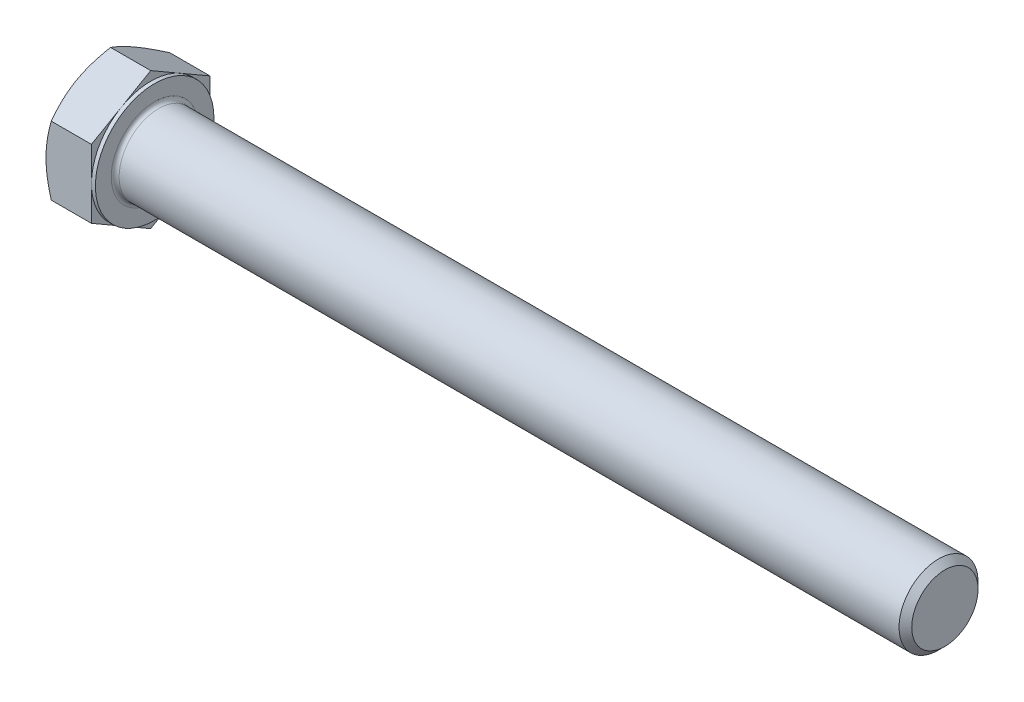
ISO-10303-21;
HEADER;
FILE_DESCRIPTION(('STEP AP214'),'2;1');
FILE_NAME('part.step','',(''),(''),'','','');
FILE_SCHEMA(('AUTOMOTIVE_DESIGN { 1 0 10303 214 1 1 1 1 }'));
ENDSEC;
DATA;
#1=APPLICATION_CONTEXT('core data for automotive mechanical design processes');
#2=APPLICATION_PROTOCOL_DEFINITION('international standard','automotive_design',2000,#1);
#3=PRODUCT_CONTEXT('',#1,'mechanical');
#4=PRODUCT('Part','Part','',(#3));
#5=PRODUCT_RELATED_PRODUCT_CATEGORY('part','',(#4));
#6=PRODUCT_DEFINITION_FORMATION('','',#4);
#7=PRODUCT_DEFINITION_CONTEXT('part definition',#1,'design');
#8=PRODUCT_DEFINITION('design','',#6,#7);
#9=PRODUCT_DEFINITION_SHAPE('','',#8);
#10=(LENGTH_UNIT() NAMED_UNIT(*) SI_UNIT(.MILLI.,.METRE.));
#11=(NAMED_UNIT(*) PLANE_ANGLE_UNIT() SI_UNIT($,.RADIAN.));
#12=(NAMED_UNIT(*) SI_UNIT($,.STERADIAN.) SOLID_ANGLE_UNIT());
#13=UNCERTAINTY_MEASURE_WITH_UNIT(LENGTH_MEASURE(1.E-05),#10,'distance_accuracy_value','');
#14=(GEOMETRIC_REPRESENTATION_CONTEXT(3) GLOBAL_UNCERTAINTY_ASSIGNED_CONTEXT((#13)) GLOBAL_UNIT_ASSIGNED_CONTEXT((#10,
#11,#12)) REPRESENTATION_CONTEXT('',''));
#15=CARTESIAN_POINT('',(0.,0.,0.));
#16=DIRECTION('',(0.,0.,1.));
#17=DIRECTION('',(1.,0.,0.));
#18=AXIS2_PLACEMENT_3D('',#15,#16,#17);
#19=CARTESIAN_POINT('',(7.5,10.3923048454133,0.));
#20=DIRECTION('',(1.,0.,0.));
#21=DIRECTION('',(0.,0.,-1.));
#22=AXIS2_PLACEMENT_3D('',#19,#20,#21);
#23=PLANE('',#22);
#24=CARTESIAN_POINT('',(7.5,0.,0.));
#25=DIRECTION('',(1.,0.,0.));
#26=DIRECTION('',(0.,0.,-1.));
#27=AXIS2_PLACEMENT_3D('',#24,#25,#26);
#28=CIRCLE('',#27,6.6);
#29=CARTESIAN_POINT('',(7.5,0.,-6.6));
#30=VERTEX_POINT('',#29);
#31=EDGE_CURVE('E40',#30,#30,#28,.F.);
#32=ORIENTED_EDGE('',*,*,#31,.T.);
#33=EDGE_LOOP('',(#32));
#34=FACE_BOUND('',#33,.T.);
#35=CARTESIAN_POINT('',(7.5,0.,0.));
#36=DIRECTION('',(1.,0.,0.));
#37=DIRECTION('',(0.,0.,-1.));
#38=AXIS2_PLACEMENT_3D('',#35,#36,#37);
#39=CIRCLE('',#38,9.);
#40=CARTESIAN_POINT('',(7.5,0.,-9.));
#41=VERTEX_POINT('',#40);
#42=EDGE_CURVE('E297',#41,#41,#39,.T.);
#43=ORIENTED_EDGE('',*,*,#42,.T.);
#44=EDGE_LOOP('',(#43));
#45=FACE_BOUND('',#44,.T.);
#46=ADVANCED_FACE('F32',(#34,#45),#23,.T.);
#47=CARTESIAN_POINT('',(0.,0.,0.));
#48=DIRECTION('',(-1.,0.,0.));
#49=DIRECTION('',(0.,0.,1.));
#50=AXIS2_PLACEMENT_3D('',#47,#48,#49);
#51=CYLINDRICAL_SURFACE('',#50,6.);
#52=CARTESIAN_POINT('',(8.1,0.,0.));
#53=DIRECTION('',(1.,0.,0.));
#54=DIRECTION('',(0.,0.,-1.));
#55=AXIS2_PLACEMENT_3D('',#52,#53,#54);
#56=CIRCLE('',#55,6.);
#57=CARTESIAN_POINT('',(8.1,0.,-6.));
#58=VERTEX_POINT('',#57);
#59=EDGE_CURVE('E11',#58,#58,#56,.T.);
#60=ORIENTED_EDGE('',*,*,#59,.T.);
#61=EDGE_LOOP('',(#60));
#62=FACE_BOUND('',#61,.T.);
#63=CARTESIAN_POINT('',(126.536,0.,0.));
#64=DIRECTION('',(-1.,0.,0.));
#65=DIRECTION('',(0.,0.,1.));
#66=AXIS2_PLACEMENT_3D('',#63,#64,#65);
#67=CIRCLE('',#66,6.);
#68=CARTESIAN_POINT('',(126.536,0.,6.));
#69=VERTEX_POINT('',#68);
#70=EDGE_CURVE('E276',#69,#69,#67,.T.);
#71=ORIENTED_EDGE('',*,*,#70,.T.);
#72=EDGE_LOOP('',(#71));
#73=FACE_BOUND('',#72,.T.);
#74=ADVANCED_FACE('F250',(#62,#73),#51,.T.);
#75=CARTESIAN_POINT('',(127.5,0.,0.));
#76=DIRECTION('',(-1.,0.,0.));
#77=DIRECTION('',(0.,0.,1.));
#78=AXIS2_PLACEMENT_3D('',#75,#76,#77);
#79=CONICAL_SURFACE('',#78,5.036,0.785398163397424);
#80=ORIENTED_EDGE('',*,*,#70,.F.);
#81=EDGE_LOOP('',(#80));
#82=FACE_BOUND('',#81,.T.);
#83=CARTESIAN_POINT('',(127.5,0.,0.));
#84=DIRECTION('',(-1.,0.,0.));
#85=DIRECTION('',(0.,0.,1.));
#86=AXIS2_PLACEMENT_3D('',#83,#84,#85);
#87=CIRCLE('',#86,5.036);
#88=CARTESIAN_POINT('',(127.5,0.,5.036));
#89=VERTEX_POINT('',#88);
#90=EDGE_CURVE('E274',#89,#89,#87,.T.);
#91=ORIENTED_EDGE('',*,*,#90,.T.);
#92=EDGE_LOOP('',(#91));
#93=FACE_BOUND('',#92,.T.);
#94=ADVANCED_FACE('F255',(#82,#93),#79,.T.);
#95=CARTESIAN_POINT('',(127.5,0.,0.));
#96=DIRECTION('',(-1.,0.,0.));
#97=DIRECTION('',(0.,0.,1.));
#98=AXIS2_PLACEMENT_3D('',#95,#96,#97);
#99=PLANE('',#98);
#100=ORIENTED_EDGE('',*,*,#90,.F.);
#101=EDGE_LOOP('',(#100));
#102=FACE_BOUND('',#101,.T.);
#103=ADVANCED_FACE('F262',(#102),#99,.F.);
#104=CARTESIAN_POINT('',(6.9,9.,0.));
#105=DIRECTION('',(1.,0.,0.));
#106=DIRECTION('',(0.,0.,-1.));
#107=AXIS2_PLACEMENT_3D('',#104,#105,#106);
#108=PLANE('',#107);
#109=DIRECTION('',(0.,0.500000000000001,0.866025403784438));
#110=VECTOR('',#109,1.);
#111=CARTESIAN_POINT('',(6.9,5.19615242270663,-9.));
#112=LINE('',#111,#110);
#113=CARTESIAN_POINT('',(6.9,5.19615242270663,-9.));
#114=VERTEX_POINT('',#113);
#115=CARTESIAN_POINT('',(6.9,7.79422863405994,-4.50000000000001));
#116=VERTEX_POINT('',#115);
#117=EDGE_CURVE('E164',#114,#116,#112,.T.);
#118=ORIENTED_EDGE('',*,*,#117,.T.);
#119=CARTESIAN_POINT('',(6.9,0.,0.));
#120=DIRECTION('',(-1.,0.,0.));
#121=DIRECTION('',(0.,0.,1.));
#122=AXIS2_PLACEMENT_3D('',#119,#120,#121);
#123=CIRCLE('',#122,9.);
#124=CARTESIAN_POINT('',(6.9,0.,-9.));
#125=VERTEX_POINT('',#124);
#126=EDGE_CURVE('E47',#116,#125,#123,.T.);
#127=ORIENTED_EDGE('',*,*,#126,.T.);
#128=DIRECTION('',(0.,1.,0.));
#129=VECTOR('',#128,1.);
#130=CARTESIAN_POINT('',(6.9,5.19615242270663,-9.));
#131=LINE('',#130,#129);
#132=EDGE_CURVE('E300',#125,#114,#131,.T.);
#133=ORIENTED_EDGE('',*,*,#132,.T.);
#134=EDGE_LOOP('',(#118,#127,#133));
#135=FACE_BOUND('',#134,.T.);
#136=ADVANCED_FACE('F265',(#135),#108,.T.);
#137=CARTESIAN_POINT('',(6.9,10.3923048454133,0.));
#138=VERTEX_POINT('',#137);
#139=EDGE_CURVE('E162',#116,#138,#112,.T.);
#140=ORIENTED_EDGE('',*,*,#139,.T.);
#141=DIRECTION('',(0.,-0.500000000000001,0.866025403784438));
#142=VECTOR('',#141,1.);
#143=CARTESIAN_POINT('',(6.9,10.3923048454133,0.));
#144=LINE('',#143,#142);
#145=CARTESIAN_POINT('',(6.9,7.79422863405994,4.50000000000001));
#146=VERTEX_POINT('',#145);
#147=EDGE_CURVE('E161',#138,#146,#144,.T.);
#148=ORIENTED_EDGE('',*,*,#147,.T.);
#149=EDGE_CURVE('E150',#146,#116,#123,.T.);
#150=ORIENTED_EDGE('',*,*,#149,.T.);
#151=EDGE_LOOP('',(#140,#148,#150));
#152=FACE_BOUND('',#151,.T.);
#153=ADVANCED_FACE('F270',(#152),#108,.T.);
#154=CARTESIAN_POINT('',(6.9,5.19615242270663,9.));
#155=VERTEX_POINT('',#154);
#156=EDGE_CURVE('E129',#146,#155,#144,.T.);
#157=ORIENTED_EDGE('',*,*,#156,.T.);
#158=DIRECTION('',(0.,-1.,0.));
#159=VECTOR('',#158,1.);
#160=CARTESIAN_POINT('',(6.9,5.19615242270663,9.));
#161=LINE('',#160,#159);
#162=CARTESIAN_POINT('',(6.9,0.,9.));
#163=VERTEX_POINT('',#162);
#164=EDGE_CURVE('E123',#155,#163,#161,.T.);
#165=ORIENTED_EDGE('',*,*,#164,.T.);
#166=EDGE_CURVE('E127',#163,#146,#123,.T.);
#167=ORIENTED_EDGE('',*,*,#166,.T.);
#168=EDGE_LOOP('',(#157,#165,#167));
#169=FACE_BOUND('',#168,.T.);
#170=ADVANCED_FACE('F125',(#169),#108,.T.);
#171=CARTESIAN_POINT('',(6.9,-5.1961524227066,9.));
#172=VERTEX_POINT('',#171);
#173=EDGE_CURVE('E133',#163,#172,#161,.T.);
#174=ORIENTED_EDGE('',*,*,#173,.T.);
#175=DIRECTION('',(0.,-0.500000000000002,-0.866025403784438));
#176=VECTOR('',#175,1.);
#177=CARTESIAN_POINT('',(6.9,-10.3923048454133,0.));
#178=LINE('',#177,#176);
#179=CARTESIAN_POINT('',(6.9,-7.79422863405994,4.50000000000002));
#180=VERTEX_POINT('',#179);
#181=EDGE_CURVE('E140',#172,#180,#178,.T.);
#182=ORIENTED_EDGE('',*,*,#181,.T.);
#183=EDGE_CURVE('E137',#180,#163,#123,.T.);
#184=ORIENTED_EDGE('',*,*,#183,.T.);
#185=EDGE_LOOP('',(#174,#182,#184));
#186=FACE_BOUND('',#185,.T.);
#187=ADVANCED_FACE('F138',(#186),#108,.T.);
#188=CARTESIAN_POINT('',(6.9,-10.3923048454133,0.));
#189=VERTEX_POINT('',#188);
#190=EDGE_CURVE('E156',#180,#189,#178,.T.);
#191=ORIENTED_EDGE('',*,*,#190,.T.);
#192=DIRECTION('',(0.,0.499999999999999,-0.866025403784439));
#193=VECTOR('',#192,1.);
#194=CARTESIAN_POINT('',(6.9,-5.19615242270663,-9.));
#195=LINE('',#194,#193);
#196=CARTESIAN_POINT('',(6.9,-7.79422863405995,-4.49999999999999));
#197=VERTEX_POINT('',#196);
#198=EDGE_CURVE('E338',#189,#197,#195,.T.);
#199=ORIENTED_EDGE('',*,*,#198,.T.);
#200=EDGE_CURVE('E144',#197,#180,#123,.T.);
#201=ORIENTED_EDGE('',*,*,#200,.T.);
#202=EDGE_LOOP('',(#191,#199,#201));
#203=FACE_BOUND('',#202,.T.);
#204=ADVANCED_FACE('F339',(#203),#108,.T.);
#205=CARTESIAN_POINT('',(6.9,-5.19615242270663,-9.));
#206=VERTEX_POINT('',#205);
#207=EDGE_CURVE('E151',#197,#206,#195,.T.);
#208=ORIENTED_EDGE('',*,*,#207,.T.);
#209=EDGE_CURVE('E301',#206,#125,#131,.T.);
#210=ORIENTED_EDGE('',*,*,#209,.T.);
#211=EDGE_CURVE('E308',#125,#197,#123,.T.);
#212=ORIENTED_EDGE('',*,*,#211,.T.);
#213=EDGE_LOOP('',(#208,#210,#212));
#214=FACE_BOUND('',#213,.T.);
#215=ADVANCED_FACE('F271',(#214),#108,.T.);
#216=CARTESIAN_POINT('',(0.,0.,0.));
#217=DIRECTION('',(-1.,0.,0.));
#218=DIRECTION('',(0.,0.,1.));
#219=AXIS2_PLACEMENT_3D('',#216,#217,#218);
#220=CYLINDRICAL_SURFACE('',#219,9.);
#221=ORIENTED_EDGE('',*,*,#126,.F.);
#222=ORIENTED_EDGE('',*,*,#149,.F.);
#223=ORIENTED_EDGE('',*,*,#166,.F.);
#224=ORIENTED_EDGE('',*,*,#183,.F.);
#225=ORIENTED_EDGE('',*,*,#200,.F.);
#226=ORIENTED_EDGE('',*,*,#211,.F.);
#227=EDGE_LOOP('',(#221,#222,#223,#224,#225,#226));
#228=FACE_BOUND('',#227,.T.);
#229=ORIENTED_EDGE('',*,*,#42,.F.);
#230=EDGE_LOOP('',(#229));
#231=FACE_BOUND('',#230,.T.);
#232=ADVANCED_FACE('F147',(#228,#231),#220,.T.);
#233=CARTESIAN_POINT('',(0.,10.3923048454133,0.));
#234=DIRECTION('',(1.,0.,0.));
#235=DIRECTION('',(0.,0.,-1.));
#236=AXIS2_PLACEMENT_3D('',#233,#234,#235);
#237=PLANE('',#236);
#238=CARTESIAN_POINT('',(0.,0.,0.));
#239=DIRECTION('',(1.,0.,0.));
#240=DIRECTION('',(0.,0.,-1.));
#241=AXIS2_PLACEMENT_3D('',#238,#239,#240);
#242=CIRCLE('',#241,9.);
#243=CARTESIAN_POINT('',(0.,0.,-9.));
#244=VERTEX_POINT('',#243);
#245=CARTESIAN_POINT('',(0.,7.79422863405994,-4.50000000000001));
#246=VERTEX_POINT('',#245);
#247=EDGE_CURVE('E296',#244,#246,#242,.T.);
#248=ORIENTED_EDGE('',*,*,#247,.F.);
#249=CARTESIAN_POINT('',(0.,-7.79422863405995,-4.49999999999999));
#250=VERTEX_POINT('',#249);
#251=EDGE_CURVE('E292',#250,#244,#242,.T.);
#252=ORIENTED_EDGE('',*,*,#251,.F.);
#253=CARTESIAN_POINT('',(0.,-7.79422863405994,4.50000000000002));
#254=VERTEX_POINT('',#253);
#255=EDGE_CURVE('E295',#254,#250,#242,.T.);
#256=ORIENTED_EDGE('',*,*,#255,.F.);
#257=CARTESIAN_POINT('',(0.,0.,9.));
#258=VERTEX_POINT('',#257);
#259=EDGE_CURVE('E331',#258,#254,#242,.T.);
#260=ORIENTED_EDGE('',*,*,#259,.F.);
#261=CARTESIAN_POINT('',(0.,0.,0.));
#262=DIRECTION('',(-1.,0.,0.));
#263=DIRECTION('',(0.,0.,1.));
#264=AXIS2_PLACEMENT_3D('',#261,#262,#263);
#265=CIRCLE('',#264,9.);
#266=CARTESIAN_POINT('',(0.,7.79422863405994,4.50000000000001));
#267=VERTEX_POINT('',#266);
#268=EDGE_CURVE('E165',#258,#267,#265,.T.);
#269=ORIENTED_EDGE('',*,*,#268,.T.);
#270=EDGE_CURVE('E354',#246,#267,#242,.T.);
#271=ORIENTED_EDGE('',*,*,#270,.F.);
#272=EDGE_LOOP('',(#248,#252,#256,#260,#269,#271));
#273=FACE_BOUND('',#272,.T.);
#274=ADVANCED_FACE('F196',(#273),#237,.F.);
#275=CARTESIAN_POINT('',(0.,0.,0.));
#276=DIRECTION('',(1.,0.,0.));
#277=DIRECTION('',(0.,0.,-1.));
#278=AXIS2_PLACEMENT_3D('',#275,#276,#277);
#279=CONICAL_SURFACE('',#278,9.,1.0471975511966);
#280=CARTESIAN_POINT('',(0.803914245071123,5.19603695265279,9.0002));
#281=CARTESIAN_POINT('',(0.737982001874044,5.31024090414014,8.80239295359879));
#282=CARTESIAN_POINT('',(0.675041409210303,5.42489028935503,8.60381439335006));
#283=CARTESIAN_POINT('',(0.555968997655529,5.65512011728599,8.20504463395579));
#284=CARTESIAN_POINT('',(0.499840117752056,5.77070093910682,8.00485277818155));
#285=CARTESIAN_POINT('',(0.395151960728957,6.00300811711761,7.60248494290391));
#286=CARTESIAN_POINT('',(0.346610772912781,6.11973652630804,7.40030540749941));
#287=CARTESIAN_POINT('',(0.258148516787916,6.35398725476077,6.99457124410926));
#288=CARTESIAN_POINT('',(0.218225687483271,6.47150940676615,6.7910169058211));
#289=CARTESIAN_POINT('',(0.148684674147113,6.70436794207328,6.38769409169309));
#290=CARTESIAN_POINT('',(0.118837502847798,6.81968712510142,6.187955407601));
#291=CARTESIAN_POINT('',(0.0687933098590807,7.05084147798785,5.78758432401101));
#292=CARTESIAN_POINT('',(0.04859543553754,7.16667660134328,5.5869520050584));
#293=CARTESIAN_POINT('',(0.0183543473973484,7.39854776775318,5.18533936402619));
#294=CARTESIAN_POINT('',(0.00829960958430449,7.51458343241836,4.98435969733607));
#295=CARTESIAN_POINT('',(-0.00143766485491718,7.74676155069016,4.58221540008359));
#296=CARTESIAN_POINT('',(-0.00112052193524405,7.86290400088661,4.38105077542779));
#297=CARTESIAN_POINT('',(0.00916395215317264,8.08003584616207,4.00496738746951));
#298=CARTESIAN_POINT('',(0.0178767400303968,8.18104055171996,3.83002210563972));
#299=CARTESIAN_POINT('',(0.0429773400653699,8.38281337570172,3.48054132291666));
#300=CARTESIAN_POINT('',(0.0593656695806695,8.4835814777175,3.30600585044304));
#301=CARTESIAN_POINT('',(0.11965655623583,8.7854956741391,2.7830751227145));
#302=CARTESIAN_POINT('',(0.174677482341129,8.98610736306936,2.43560548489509));
#303=CARTESIAN_POINT('',(0.312230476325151,9.38945876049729,1.73698037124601));
#304=CARTESIAN_POINT('',(0.395345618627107,9.59214699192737,1.38591405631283));
#305=CARTESIAN_POINT('',(0.583982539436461,9.99450087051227,0.689016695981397));
#306=CARTESIAN_POINT('',(0.689460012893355,10.1941716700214,0.343176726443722));
#307=CARTESIAN_POINT('',(0.803914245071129,10.3924203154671,-0.000200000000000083));
#308=B_SPLINE_CURVE_WITH_KNOTS('',3,(#280,#281,#282,#283,#284,#285,#286,#287,#288,#289,#290,
#291,#292,#293,#294,#295,#296,#297,#298,#299,#300,#301,#302,#303,#304,#305,#306,#307),
.UNSPECIFIED.,.F.,.F.,(4,2,2,2,2,2,2,2,2,2,2,2,2,4),(0.,0.713219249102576,1.42674513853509,
2.14194697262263,2.8570025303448,3.55449749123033,4.25193080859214,4.94857085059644,
5.64518936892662,6.25162976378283,6.8581110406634,8.07193747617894,9.31268391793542,
10.5509947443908),.UNSPECIFIED.);
#309=CARTESIAN_POINT('',(0.803847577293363,10.3923048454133,0.));
#310=VERTEX_POINT('',#309);
#311=EDGE_CURVE('E216',#267,#310,#308,.T.);
#312=ORIENTED_EDGE('',*,*,#311,.T.);
#313=CARTESIAN_POINT('',(0.803914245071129,10.3924203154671,0.000200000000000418));
#314=CARTESIAN_POINT('',(0.73798200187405,10.2782163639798,-0.197607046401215));
#315=CARTESIAN_POINT('',(0.675041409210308,10.1635669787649,-0.396185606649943));
#316=CARTESIAN_POINT('',(0.555968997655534,9.93333715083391,-0.794955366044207));
#317=CARTESIAN_POINT('',(0.499840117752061,9.81775632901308,-0.995147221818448));
#318=CARTESIAN_POINT('',(0.395151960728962,9.58544915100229,-1.39751505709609));
#319=CARTESIAN_POINT('',(0.346610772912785,9.46872074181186,-1.59969459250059));
#320=CARTESIAN_POINT('',(0.25814851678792,9.23447001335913,-2.00542875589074));
#321=CARTESIAN_POINT('',(0.218225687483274,9.11694786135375,-2.20898309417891));
#322=CARTESIAN_POINT('',(0.148684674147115,8.88408932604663,-2.61230590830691));
#323=CARTESIAN_POINT('',(0.1188375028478,8.76877014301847,-2.812044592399));
#324=CARTESIAN_POINT('',(0.0687933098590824,8.53761579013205,-3.21241567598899));
#325=CARTESIAN_POINT('',(0.048595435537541,8.42178066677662,-3.4130479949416));
#326=CARTESIAN_POINT('',(0.0183543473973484,8.18990950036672,-3.81466063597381));
#327=CARTESIAN_POINT('',(0.00829960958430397,8.07387383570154,-4.01564030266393));
#328=CARTESIAN_POINT('',(-0.00143766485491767,7.84169571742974,-4.41778459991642));
#329=CARTESIAN_POINT('',(-0.00112052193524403,7.72555326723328,-4.61894922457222));
#330=CARTESIAN_POINT('',(0.00916395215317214,7.50842142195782,-4.9950326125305));
#331=CARTESIAN_POINT('',(0.0178767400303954,7.40741671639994,-5.16997789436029));
#332=CARTESIAN_POINT('',(0.042977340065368,7.20564389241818,-5.51945867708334));
#333=CARTESIAN_POINT('',(0.0593656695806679,7.1048757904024,-5.69399414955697));
#334=CARTESIAN_POINT('',(0.119656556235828,6.8029615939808,-6.2169248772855));
#335=CARTESIAN_POINT('',(0.174677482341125,6.60234990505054,-6.56439451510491));
#336=CARTESIAN_POINT('',(0.312230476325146,6.1989985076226,-7.263019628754));
#337=CARTESIAN_POINT('',(0.395345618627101,5.99631027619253,-7.61408594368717));
#338=CARTESIAN_POINT('',(0.583982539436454,5.59395639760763,-8.3109833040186));
#339=CARTESIAN_POINT('',(0.689460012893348,5.39428559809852,-8.65682327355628));
#340=CARTESIAN_POINT('',(0.803914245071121,5.19603695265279,-9.0002));
#341=B_SPLINE_CURVE_WITH_KNOTS('',3,(#313,#314,#315,#316,#317,#318,#319,#320,#321,#322,#323,
#324,#325,#326,#327,#328,#329,#330,#331,#332,#333,#334,#335,#336,#337,#338,#339,#340),
.UNSPECIFIED.,.F.,.F.,(4,2,2,2,2,2,2,2,2,2,2,2,2,4),(0.,0.713219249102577,1.42674513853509,
2.14194697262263,2.8570025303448,3.55449749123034,4.25193080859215,4.94857085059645,
5.64518936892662,6.25162976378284,6.85811104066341,8.07193747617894,9.31268391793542,
10.5509947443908),.UNSPECIFIED.);
#342=EDGE_CURVE('E55',#310,#246,#341,.T.);
#343=ORIENTED_EDGE('',*,*,#342,.T.);
#344=ORIENTED_EDGE('',*,*,#270,.T.);
#345=EDGE_LOOP('',(#312,#343,#344));
#346=FACE_BOUND('',#345,.T.);
#347=ADVANCED_FACE('F355',(#346),#279,.T.);
#348=CARTESIAN_POINT('',(4.5030834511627,-14.1853984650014,8.99999999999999));
#349=CARTESIAN_POINT('',(4.31054430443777,-13.7903499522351,8.99999999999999));
#350=CARTESIAN_POINT('',(4.11978647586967,-13.3944187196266,8.99999999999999));
#351=CARTESIAN_POINT('',(3.74283090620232,-12.6003222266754,8.99999999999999));
#352=CARTESIAN_POINT('',(3.55663384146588,-12.2021566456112,9.));
#353=CARTESIAN_POINT('',(3.18890856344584,-11.4011783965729,9.));
#354=CARTESIAN_POINT('',(3.00740939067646,-10.9983523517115,9.));
#355=CARTESIAN_POINT('',(2.65153988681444,-10.1895752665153,9.));
#356=CARTESIAN_POINT('',(2.47716923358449,-9.7836243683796,9.));
#357=CARTESIAN_POINT('',(2.13161244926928,-8.95398189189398,9.));
#358=CARTESIAN_POINT('',(1.96074001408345,-8.53015895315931,9.));
#359=CARTESIAN_POINT('',(1.63138410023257,-7.67764040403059,9.));
#360=CARTESIAN_POINT('',(1.47290197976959,-7.24894426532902,9.));
#361=CARTESIAN_POINT('',(1.17232155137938,-6.38672363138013,9.));
#362=CARTESIAN_POINT('',(1.03019194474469,-5.95321016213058,9.));
#363=CARTESIAN_POINT('',(0.766724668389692,-5.07998336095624,9.));
#364=CARTESIAN_POINT('',(0.645380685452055,-4.64027195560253,9.));
#365=CARTESIAN_POINT('',(0.429822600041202,-3.75682505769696,9.));
#366=CARTESIAN_POINT('',(0.335452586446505,-3.31312863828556,9.));
#367=CARTESIAN_POINT('',(0.218090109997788,-2.64336713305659,9.));
#368=CARTESIAN_POINT('',(0.182999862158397,-2.41939560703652,9.));
#369=CARTESIAN_POINT('',(0.121565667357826,-1.97026354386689,9.));
#370=CARTESIAN_POINT('',(0.0952208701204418,-1.74510312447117,9.));
#371=CARTESIAN_POINT('',(0.0521451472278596,-1.2969348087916,9.));
#372=CARTESIAN_POINT('',(0.0352889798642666,-1.0739390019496,9.));
#373=CARTESIAN_POINT('',(0.0110310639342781,-0.627433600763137,9.));
#374=CARTESIAN_POINT('',(0.00362915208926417,-0.403924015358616,9.));
#375=CARTESIAN_POINT('',(-0.00154262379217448,0.0432079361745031,9.));
#376=CARTESIAN_POINT('',(0.000687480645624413,0.266830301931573,9.));
#377=CARTESIAN_POINT('',(0.0147226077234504,0.713776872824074,9.));
#378=CARTESIAN_POINT('',(0.0265280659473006,0.937101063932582,9.));
#379=CARTESIAN_POINT('',(0.0656502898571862,1.46707211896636,9.));
#380=CARTESIAN_POINT('',(0.0971347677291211,1.77341845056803,9.));
#381=CARTESIAN_POINT('',(0.176454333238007,2.38397028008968,9.));
#382=CARTESIAN_POINT('',(0.224291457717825,2.68817550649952,9.));
#383=CARTESIAN_POINT('',(0.38980640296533,3.59715813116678,9.));
#384=CARTESIAN_POINT('',(0.529461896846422,4.19799412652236,9.));
#385=CARTESIAN_POINT('',(0.77333187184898,5.09670706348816,9.));
#386=CARTESIAN_POINT('',(0.861532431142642,5.39919910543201,9.));
#387=CARTESIAN_POINT('',(1.04752099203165,6.00125026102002,9.));
#388=CARTESIAN_POINT('',(1.14530906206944,6.30080935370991,9.));
#389=CARTESIAN_POINT('',(1.34886866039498,6.89708058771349,9.));
#390=CARTESIAN_POINT('',(1.45463787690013,7.19379352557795,9.));
#391=CARTESIAN_POINT('',(1.67287301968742,7.78473287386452,9.));
#392=CARTESIAN_POINT('',(1.78533883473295,8.07895932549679,9.));
#393=CARTESIAN_POINT('',(2.07523735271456,8.81619444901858,9.));
#394=CARTESIAN_POINT('',(2.25629467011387,9.25777584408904,9.));
#395=CARTESIAN_POINT('',(2.62827522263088,10.1367776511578,9.));
#396=CARTESIAN_POINT('',(2.819199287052,10.5741977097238,9.));
#397=CARTESIAN_POINT('',(3.20877963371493,11.4457286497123,9.));
#398=CARTESIAN_POINT('',(3.40743823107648,11.8798384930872,9.));
#399=CARTESIAN_POINT('',(3.81079737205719,12.7452179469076,9.));
#400=CARTESIAN_POINT('',(4.01549773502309,13.176487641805,9.00000000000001));
#401=CARTESIAN_POINT('',(4.43000777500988,14.0372827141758,9.00000000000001));
#402=CARTESIAN_POINT('',(4.63982402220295,14.4668049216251,9.00000000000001));
#403=CARTESIAN_POINT('',(5.06336871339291,15.3239162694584,9.00000000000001));
#404=CARTESIAN_POINT('',(5.27709718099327,15.7515053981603,9.00000000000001));
#405=CARTESIAN_POINT('',(5.70771289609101,16.6049951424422,9.00000000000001));
#406=CARTESIAN_POINT('',(5.92459958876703,17.0308960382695,9.00000000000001));
#407=CARTESIAN_POINT('',(6.36101693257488,17.8813418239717,9.00000000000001));
#408=CARTESIAN_POINT('',(6.58054759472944,18.305886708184,9.00000000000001));
#409=CARTESIAN_POINT('',(7.20096689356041,19.4981240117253,9.00000000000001));
#410=CARTESIAN_POINT('',(7.60436223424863,20.2645118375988,9.00000000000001));
#411=CARTESIAN_POINT('',(8.41646747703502,21.7945065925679,9.00000000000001));
#412=CARTESIAN_POINT('',(8.82517763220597,22.558113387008,9.00000000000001));
#413=CARTESIAN_POINT('',(9.64538992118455,24.0808854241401,9.00000000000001));
#414=CARTESIAN_POINT('',(10.0568800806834,24.8400571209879,9.00000000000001));
#415=CARTESIAN_POINT('',(10.6764233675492,25.9775231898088,9.00000000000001));
#416=CARTESIAN_POINT('',(10.8833155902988,26.3564507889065,9.00000000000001));
#417=CARTESIAN_POINT('',(11.2977907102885,27.1139273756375,9.00000000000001));
#418=CARTESIAN_POINT('',(11.5053736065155,27.492476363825,9.00000000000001));
#419=CARTESIAN_POINT('',(11.7132605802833,27.8708583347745,9.00000000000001));
#420=B_SPLINE_CURVE_WITH_KNOTS('',3,(#348,#349,#350,#351,#352,#353,#354,#355,#356,#357,#358,
#359,#360,#361,#362,#363,#364,#365,#366,#367,#368,#369,#370,#371,#372,#373,#374,#375,#376,#377,
#378,#379,#380,#381,#382,#383,#384,#385,#386,#387,#388,#389,#390,#391,#392,#393,#394,#395,#396,
#397,#398,#399,#400,#401,#402,#403,#404,#405,#406,#407,#408,#409,#410,#411,#412,#413,#414,#415,
#416,#417,#418,#419),.UNSPECIFIED.,.F.,.F.,(4,2,2,2,2,2,2,2,2,2,2,2,2,2,2,2,2,2,2,2,2,2,2,2,2,2,
2,2,2,2,2,2,2,2,2,4),(0.,1.31842765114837,2.6370496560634,3.96247407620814,5.28783853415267,
6.65860358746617,8.029518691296,9.3977646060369,10.7655942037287,12.1253499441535,
12.8053173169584,13.4852185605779,14.1559216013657,14.8266130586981,15.4973023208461,
16.1680220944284,17.0913849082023,18.0148627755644,19.862742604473,20.8079230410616,
21.7531102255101,22.6980246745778,23.6429234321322,25.0745302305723,26.5062575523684,
27.9384167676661,29.3705332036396,30.8045973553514,32.2386701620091,33.6724940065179,
35.1063238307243,37.7045032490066,40.3028068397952,42.8933552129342,44.1885437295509,
45.4837303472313),.UNSPECIFIED.);
#421=CARTESIAN_POINT('',(0.803847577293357,5.19615242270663,9.));
#422=VERTEX_POINT('',#421);
#423=EDGE_CURVE('E230',#258,#422,#420,.T.);
#424=ORIENTED_EDGE('',*,*,#423,.T.);
#425=EDGE_CURVE('E229',#422,#267,#308,.T.);
#426=ORIENTED_EDGE('',*,*,#425,.T.);
#427=ORIENTED_EDGE('',*,*,#268,.F.);
#428=EDGE_LOOP('',(#424,#426,#427));
#429=FACE_BOUND('',#428,.T.);
#430=ADVANCED_FACE('F325',(#429),#279,.T.);
#431=CARTESIAN_POINT('',(0.803847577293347,-5.1961524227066,9.));
#432=VERTEX_POINT('',#431);
#433=EDGE_CURVE('E277',#432,#258,#420,.T.);
#434=ORIENTED_EDGE('',*,*,#433,.T.);
#435=ORIENTED_EDGE('',*,*,#259,.T.);
#436=CARTESIAN_POINT('',(0.803914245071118,-10.3924203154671,-0.000200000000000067));
#437=CARTESIAN_POINT('',(0.737982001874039,-10.2782163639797,0.197607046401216));
#438=CARTESIAN_POINT('',(0.675041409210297,-10.1635669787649,0.396185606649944));
#439=CARTESIAN_POINT('',(0.555968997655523,-9.93333715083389,0.794955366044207));
#440=CARTESIAN_POINT('',(0.499840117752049,-9.81775632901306,0.995147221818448));
#441=CARTESIAN_POINT('',(0.39515196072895,-9.58544915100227,1.39751505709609));
#442=CARTESIAN_POINT('',(0.346610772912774,-9.46872074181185,1.59969459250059));
#443=CARTESIAN_POINT('',(0.258148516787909,-9.23447001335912,2.00542875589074));
#444=CARTESIAN_POINT('',(0.218225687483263,-9.11694786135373,2.2089830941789));
#445=CARTESIAN_POINT('',(0.148684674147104,-8.88408932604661,2.6123059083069));
#446=CARTESIAN_POINT('',(0.118837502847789,-8.76877014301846,2.81204459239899));
#447=CARTESIAN_POINT('',(0.0687933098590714,-8.53761579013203,3.21241567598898));
#448=CARTESIAN_POINT('',(0.0485954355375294,-8.4217806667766,3.41304799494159));
#449=CARTESIAN_POINT('',(0.0183543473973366,-8.1899095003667,3.8146606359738));
#450=CARTESIAN_POINT('',(0.00829960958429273,-8.07387383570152,4.01564030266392));
#451=CARTESIAN_POINT('',(-0.00143766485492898,-7.84169571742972,4.41778459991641));
#452=CARTESIAN_POINT('',(-0.00112052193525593,-7.72555326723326,4.61894922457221));
#453=CARTESIAN_POINT('',(0.00916395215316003,-7.5084214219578,4.99503261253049));
#454=CARTESIAN_POINT('',(0.0178767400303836,-7.40741671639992,5.16997789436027));
#455=CARTESIAN_POINT('',(0.0429773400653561,-7.20564389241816,5.51945867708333));
#456=CARTESIAN_POINT('',(0.0593656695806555,-7.10487579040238,5.69399414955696));
#457=CARTESIAN_POINT('',(0.119656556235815,-6.80296159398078,6.21692487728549));
#458=CARTESIAN_POINT('',(0.174677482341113,-6.60234990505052,6.5643945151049));
#459=CARTESIAN_POINT('',(0.312230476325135,-6.19899850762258,7.26301962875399));
#460=CARTESIAN_POINT('',(0.39534561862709,-5.9963102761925,7.61408594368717));
#461=CARTESIAN_POINT('',(0.583982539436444,-5.5939563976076,8.3109833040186));
#462=CARTESIAN_POINT('',(0.689460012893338,-5.3942855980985,8.65682327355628));
#463=CARTESIAN_POINT('',(0.803914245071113,-5.19603695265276,9.0002));
#464=B_SPLINE_CURVE_WITH_KNOTS('',3,(#436,#437,#438,#439,#440,#441,#442,#443,#444,#445,#446,
#447,#448,#449,#450,#451,#452,#453,#454,#455,#456,#457,#458,#459,#460,#461,#462,#463),
.UNSPECIFIED.,.F.,.F.,(4,2,2,2,2,2,2,2,2,2,2,2,2,4),(0.,0.713219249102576,1.42674513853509,
2.14194697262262,2.8570025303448,3.55449749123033,4.25193080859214,4.94857085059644,
5.64518936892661,6.25162976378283,6.8581110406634,8.07193747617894,9.31268391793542,
10.5509947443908),.UNSPECIFIED.);
#465=EDGE_CURVE('E218',#254,#432,#464,.T.);
#466=ORIENTED_EDGE('',*,*,#465,.T.);
#467=EDGE_LOOP('',(#434,#435,#466));
#468=FACE_BOUND('',#467,.T.);
#469=ADVANCED_FACE('F185',(#468),#279,.T.);
#470=CARTESIAN_POINT('',(0.803847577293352,-10.3923048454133,0.));
#471=VERTEX_POINT('',#470);
#472=EDGE_CURVE('E210',#471,#254,#464,.T.);
#473=ORIENTED_EDGE('',*,*,#472,.T.);
#474=ORIENTED_EDGE('',*,*,#255,.T.);
#475=CARTESIAN_POINT('',(0.803914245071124,-5.1960369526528,-9.0002));
#476=CARTESIAN_POINT('',(0.737982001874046,-5.31024090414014,-8.80239295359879));
#477=CARTESIAN_POINT('',(0.675041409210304,-5.42489028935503,-8.60381439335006));
#478=CARTESIAN_POINT('',(0.555968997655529,-5.65512011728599,-8.20504463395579));
#479=CARTESIAN_POINT('',(0.499840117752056,-5.77070093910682,-8.00485277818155));
#480=CARTESIAN_POINT('',(0.395151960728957,-6.00300811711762,-7.60248494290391));
#481=CARTESIAN_POINT('',(0.346610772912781,-6.11973652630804,-7.40030540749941));
#482=CARTESIAN_POINT('',(0.258148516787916,-6.35398725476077,-6.99457124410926));
#483=CARTESIAN_POINT('',(0.21822568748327,-6.47150940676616,-6.79101690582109));
#484=CARTESIAN_POINT('',(0.148684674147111,-6.70436794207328,-6.38769409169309));
#485=CARTESIAN_POINT('',(0.118837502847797,-6.81968712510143,-6.187955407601));
#486=CARTESIAN_POINT('',(0.0687933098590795,-7.05084147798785,-5.78758432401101));
#487=CARTESIAN_POINT('',(0.0485954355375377,-7.16667660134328,-5.5869520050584));
#488=CARTESIAN_POINT('',(0.018354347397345,-7.39854776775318,-5.18533936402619));
#489=CARTESIAN_POINT('',(0.00829960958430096,-7.51458343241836,-4.98435969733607));
#490=CARTESIAN_POINT('',(-0.00143766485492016,-7.74676155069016,-4.58221540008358));
#491=CARTESIAN_POINT('',(-0.00112052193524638,-7.86290400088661,-4.38105077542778));
#492=CARTESIAN_POINT('',(0.00916395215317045,-8.08003584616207,-4.0049673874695));
#493=CARTESIAN_POINT('',(0.0178767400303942,-8.18104055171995,-3.83002210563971));
#494=CARTESIAN_POINT('',(0.0429773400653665,-8.38281337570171,-3.48054132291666));
#495=CARTESIAN_POINT('',(0.0593656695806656,-8.4835814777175,-3.30600585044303));
#496=CARTESIAN_POINT('',(0.119656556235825,-8.78549567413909,-2.7830751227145));
#497=CARTESIAN_POINT('',(0.174677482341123,-8.98610736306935,-2.43560548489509));
#498=CARTESIAN_POINT('',(0.312230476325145,-9.38945876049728,-1.736980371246));
#499=CARTESIAN_POINT('',(0.3953456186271,-9.59214699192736,-1.38591405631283));
#500=CARTESIAN_POINT('',(0.583982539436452,-9.99450087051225,-0.689016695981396));
#501=CARTESIAN_POINT('',(0.689460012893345,-10.1941716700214,-0.343176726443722));
#502=CARTESIAN_POINT('',(0.803914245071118,-10.3924203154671,0.000200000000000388));
#503=B_SPLINE_CURVE_WITH_KNOTS('',3,(#475,#476,#477,#478,#479,#480,#481,#482,#483,#484,#485,
#486,#487,#488,#489,#490,#491,#492,#493,#494,#495,#496,#497,#498,#499,#500,#501,#502),
.UNSPECIFIED.,.F.,.F.,(4,2,2,2,2,2,2,2,2,2,2,2,2,4),(0.,0.713219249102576,1.42674513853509,
2.14194697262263,2.8570025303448,3.55449749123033,4.25193080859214,4.94857085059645,
5.64518936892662,6.25162976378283,6.8581110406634,8.07193747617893,9.31268391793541,
10.5509947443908),.UNSPECIFIED.);
#504=EDGE_CURVE('E217',#250,#471,#503,.T.);
#505=ORIENTED_EDGE('',*,*,#504,.T.);
#506=EDGE_LOOP('',(#473,#474,#505));
#507=FACE_BOUND('',#506,.T.);
#508=ADVANCED_FACE('F353',(#507),#279,.T.);
#509=CARTESIAN_POINT('',(0.803847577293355,5.19615242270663,-9.));
#510=VERTEX_POINT('',#509);
#511=EDGE_CURVE('E219',#246,#510,#341,.T.);
#512=ORIENTED_EDGE('',*,*,#511,.T.);
#513=CARTESIAN_POINT('',(4.50308345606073,-14.1853984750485,-9.));
#514=CARTESIAN_POINT('',(4.31054430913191,-13.7903499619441,-9.));
#515=CARTESIAN_POINT('',(4.11978648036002,-13.3944187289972,-9.));
#516=CARTESIAN_POINT('',(3.74283091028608,-12.6003222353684,-9.));
#517=CARTESIAN_POINT('',(3.55663384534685,-12.2021566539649,-9.));
#518=CARTESIAN_POINT('',(3.1889085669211,-11.4011784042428,-9.));
#519=CARTESIAN_POINT('',(3.00740939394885,-10.998352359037,-9.));
#520=CARTESIAN_POINT('',(2.65153988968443,-10.1895752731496,-9.));
#521=CARTESIAN_POINT('',(2.47716923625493,-9.78362437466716,-9.));
#522=CARTESIAN_POINT('',(2.13161245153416,-8.95398189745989,-9.));
#523=CARTESIAN_POINT('',(1.96074001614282,-8.53015895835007,-9.));
#524=CARTESIAN_POINT('',(1.63138410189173,-7.67764040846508,-9.));
#525=CARTESIAN_POINT('',(1.47290198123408,-7.24894426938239,-9.));
#526=CARTESIAN_POINT('',(1.17232155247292,-6.38672363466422,-9.));
#527=CARTESIAN_POINT('',(1.0301919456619,-5.95321016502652,-9.));
#528=CARTESIAN_POINT('',(0.766724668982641,-5.07998336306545,-9.));
#529=CARTESIAN_POINT('',(0.645380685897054,-4.64027195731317,-9.));
#530=CARTESIAN_POINT('',(0.429822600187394,-3.75682505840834,-9.));
#531=CARTESIAN_POINT('',(0.335452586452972,-3.31312863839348,-9.));
#532=CARTESIAN_POINT('',(0.218090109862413,-2.64336713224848,-9.));
#533=CARTESIAN_POINT('',(0.182999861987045,-2.41939560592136,-9.));
#534=CARTESIAN_POINT('',(0.12156566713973,-1.97026354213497,-9.));
#535=CARTESIAN_POINT('',(0.0952208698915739,-1.74510312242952,-9.));
#536=CARTESIAN_POINT('',(0.052145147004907,-1.29693480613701,-9.));
#537=CARTESIAN_POINT('',(0.0352889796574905,-1.07393899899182,-9.));
#538=CARTESIAN_POINT('',(0.0110310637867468,-0.627433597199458,-9.));
#539=CARTESIAN_POINT('',(0.00362915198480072,-0.403924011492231,-9.));
#540=CARTESIAN_POINT('',(-0.00154262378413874,0.0432079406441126,-9.));
#541=CARTESIAN_POINT('',(0.000687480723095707,0.266830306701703,-9.));
#542=CARTESIAN_POINT('',(0.0147226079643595,0.713776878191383,-9.));
#543=CARTESIAN_POINT('',(0.0265280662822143,0.93710106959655,-9.));
#544=CARTESIAN_POINT('',(0.0656502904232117,1.46707212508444,-9.));
#545=CARTESIAN_POINT('',(0.0971347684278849,1.77341845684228,-9.));
#546=CARTESIAN_POINT('',(0.176454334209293,2.3839702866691,-9.));
#547=CARTESIAN_POINT('',(0.224291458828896,2.68817551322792,-9.));
#548=CARTESIAN_POINT('',(0.389806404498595,3.59715813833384,-9.));
#549=CARTESIAN_POINT('',(0.529461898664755,4.19799413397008,-9.));
#550=CARTESIAN_POINT('',(0.773331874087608,5.09670707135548,-9.));
#551=CARTESIAN_POINT('',(0.861532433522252,5.39919911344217,-9.));
#552=CARTESIAN_POINT('',(1.04752099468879,6.00125026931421,-9.));
#553=CARTESIAN_POINT('',(1.14530906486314,6.30080936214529,-9.));
#554=CARTESIAN_POINT('',(1.34886866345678,6.89708059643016,-9.));
#555=CARTESIAN_POINT('',(1.45463788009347,7.19379353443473,-9.));
#556=CARTESIAN_POINT('',(1.67287302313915,7.78473288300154,-9.));
#557=CARTESIAN_POINT('',(1.78533883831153,8.07895933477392,-9.));
#558=CARTESIAN_POINT('',(2.07523735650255,8.81619445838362,-9.));
#559=CARTESIAN_POINT('',(2.25629467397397,9.25777585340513,-9.));
#560=CARTESIAN_POINT('',(2.62827522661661,10.136777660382,-9.));
#561=CARTESIAN_POINT('',(2.81919929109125,10.5741977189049,-9.));
#562=CARTESIAN_POINT('',(3.20877963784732,11.445728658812,-9.));
#563=CARTESIAN_POINT('',(3.40743823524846,11.8798385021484,-9.));
#564=CARTESIAN_POINT('',(3.81079737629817,12.745217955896,-9.));
#565=CARTESIAN_POINT('',(4.01549773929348,13.176487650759,-9.));
#566=CARTESIAN_POINT('',(4.43000777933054,14.0372827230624,-9.));
#567=CARTESIAN_POINT('',(4.63982402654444,14.4668049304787,-9.));
#568=CARTESIAN_POINT('',(5.06336871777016,15.3239162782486,-9.));
#569=CARTESIAN_POINT('',(5.27709718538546,15.7515054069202,-9.));
#570=CARTESIAN_POINT('',(5.70771290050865,16.6049951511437,-9.));
#571=CARTESIAN_POINT('',(5.9245995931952,17.0308960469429,-9.));
#572=CARTESIAN_POINT('',(6.36101693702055,17.8813418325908,-9.));
#573=CARTESIAN_POINT('',(6.58054759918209,18.3058867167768,-9.));
#574=CARTESIAN_POINT('',(7.20096689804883,19.4981240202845,-9.));
#575=CARTESIAN_POINT('',(7.60436223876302,20.2645118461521,-9.));
#576=CARTESIAN_POINT('',(8.41646748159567,21.794506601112,-9.));
#577=CARTESIAN_POINT('',(8.82517763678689,22.558113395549,-9.));
#578=CARTESIAN_POINT('',(9.64538992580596,24.0808854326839,-9.));
#579=CARTESIAN_POINT('',(10.0568800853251,24.8400571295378,-9.));
#580=CARTESIAN_POINT('',(10.6764233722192,25.977523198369,-9.));
#581=CARTESIAN_POINT('',(10.883315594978,26.3564507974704,-9.));
#582=CARTESIAN_POINT('',(11.2977907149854,27.113927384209,-9.));
#583=CARTESIAN_POINT('',(11.505373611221,27.4924763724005,-9.));
#584=CARTESIAN_POINT('',(11.713260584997,27.8708583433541,-9.));
#585=B_SPLINE_CURVE_WITH_KNOTS('',3,(#513,#514,#515,#516,#517,#518,#519,#520,#521,#522,#523,
#524,#525,#526,#527,#528,#529,#530,#531,#532,#533,#534,#535,#536,#537,#538,#539,#540,#541,#542,
#543,#544,#545,#546,#547,#548,#549,#550,#551,#552,#553,#554,#555,#556,#557,#558,#559,#560,#561,
#562,#563,#564,#565,#566,#567,#568,#569,#570,#571,#572,#573,#574,#575,#576,#577,#578,#579,#580,
#581,#582,#583,#584),.UNSPECIFIED.,.F.,.F.,(4,2,2,2,2,2,2,2,2,2,2,2,2,2,2,2,2,2,2,2,2,2,2,2,2,2,
2,2,2,2,2,2,2,2,2,4),(0.,1.3184276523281,2.63704965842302,3.96247407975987,5.28783853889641,
6.65860359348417,8.02951869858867,9.39776461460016,10.7655942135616,12.1253499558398,
12.8053173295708,13.4852185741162,14.1559216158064,14.8266130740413,15.497302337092,
16.1680221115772,17.0913849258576,18.0148627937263,19.8627426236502,20.8079230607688,
21.7531102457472,22.6980246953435,23.6429234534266,25.0745302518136,26.506257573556,
27.9384167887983,29.3705332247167,30.804597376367,32.2386701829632,33.6724940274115,
35.1063238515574,37.7045032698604,40.3028068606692,42.8933552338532,44.1885437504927,
45.4837303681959),.UNSPECIFIED.);
#586=EDGE_CURVE('E177',#510,#244,#585,.F.);
#587=ORIENTED_EDGE('',*,*,#586,.T.);
#588=ORIENTED_EDGE('',*,*,#247,.T.);
#589=EDGE_LOOP('',(#512,#587,#588));
#590=FACE_BOUND('',#589,.T.);
#591=ADVANCED_FACE('F350',(#590),#279,.T.);
#592=CARTESIAN_POINT('',(0.803847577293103,-5.19615242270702,-9.));
#593=VERTEX_POINT('',#592);
#594=EDGE_CURVE('E178',#593,#250,#503,.T.);
#595=ORIENTED_EDGE('',*,*,#594,.T.);
#596=ORIENTED_EDGE('',*,*,#251,.T.);
#597=EDGE_CURVE('E168',#244,#593,#585,.F.);
#598=ORIENTED_EDGE('',*,*,#597,.T.);
#599=EDGE_LOOP('',(#595,#596,#598));
#600=FACE_BOUND('',#599,.T.);
#601=ADVANCED_FACE('F194',(#600),#279,.T.);
#602=CARTESIAN_POINT('',(7.5,5.19615242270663,-9.));
#603=DIRECTION('',(0.,0.,1.));
#604=DIRECTION('',(0.,-1.,0.));
#605=AXIS2_PLACEMENT_3D('',#602,#603,#604);
#606=PLANE('',#605);
#607=ORIENTED_EDGE('',*,*,#209,.F.);
#608=DIRECTION('',(-1.,0.,0.));
#609=VECTOR('',#608,1.);
#610=CARTESIAN_POINT('',(7.5,-5.19615242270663,-9.));
#611=LINE('',#610,#609);
#612=EDGE_CURVE('E283',#206,#593,#611,.T.);
#613=ORIENTED_EDGE('',*,*,#612,.T.);
#614=ORIENTED_EDGE('',*,*,#597,.F.);
#615=ORIENTED_EDGE('',*,*,#586,.F.);
#616=DIRECTION('',(-1.,0.,0.));
#617=VECTOR('',#616,1.);
#618=CARTESIAN_POINT('',(7.5,5.19615242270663,-9.));
#619=LINE('',#618,#617);
#620=EDGE_CURVE('E279',#114,#510,#619,.T.);
#621=ORIENTED_EDGE('',*,*,#620,.F.);
#622=ORIENTED_EDGE('',*,*,#132,.F.);
#623=EDGE_LOOP('',(#607,#613,#614,#615,#621,#622));
#624=FACE_BOUND('',#623,.T.);
#625=ADVANCED_FACE('F189',(#624),#606,.F.);
#626=CARTESIAN_POINT('',(7.5,-5.19615242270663,-9.));
#627=DIRECTION('',(0.,0.866025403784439,0.499999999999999));
#628=DIRECTION('',(0.,-0.499999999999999,0.866025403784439));
#629=AXIS2_PLACEMENT_3D('',#626,#627,#628);
#630=PLANE('',#629);
#631=ORIENTED_EDGE('',*,*,#198,.F.);
#632=DIRECTION('',(-1.,0.,0.));
#633=VECTOR('',#632,1.);
#634=CARTESIAN_POINT('',(7.5,-10.3923048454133,0.));
#635=LINE('',#634,#633);
#636=EDGE_CURVE('E285',#189,#471,#635,.T.);
#637=ORIENTED_EDGE('',*,*,#636,.T.);
#638=ORIENTED_EDGE('',*,*,#504,.F.);
#639=ORIENTED_EDGE('',*,*,#594,.F.);
#640=ORIENTED_EDGE('',*,*,#612,.F.);
#641=ORIENTED_EDGE('',*,*,#207,.F.);
#642=EDGE_LOOP('',(#631,#637,#638,#639,#640,#641));
#643=FACE_BOUND('',#642,.T.);
#644=ADVANCED_FACE('F193',(#643),#630,.F.);
#645=CARTESIAN_POINT('',(7.5,-10.3923048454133,0.));
#646=DIRECTION('',(0.,0.866025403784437,-0.500000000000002));
#647=DIRECTION('',(0.,0.500000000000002,0.866025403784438));
#648=AXIS2_PLACEMENT_3D('',#645,#646,#647);
#649=PLANE('',#648);
#650=ORIENTED_EDGE('',*,*,#181,.F.);
#651=DIRECTION('',(-1.,0.,0.));
#652=VECTOR('',#651,1.);
#653=CARTESIAN_POINT('',(7.5,-5.1961524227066,9.));
#654=LINE('',#653,#652);
#655=EDGE_CURVE('E155',#172,#432,#654,.T.);
#656=ORIENTED_EDGE('',*,*,#655,.T.);
#657=ORIENTED_EDGE('',*,*,#465,.F.);
#658=ORIENTED_EDGE('',*,*,#472,.F.);
#659=ORIENTED_EDGE('',*,*,#636,.F.);
#660=ORIENTED_EDGE('',*,*,#190,.F.);
#661=EDGE_LOOP('',(#650,#656,#657,#658,#659,#660));
#662=FACE_BOUND('',#661,.T.);
#663=ADVANCED_FACE('F201',(#662),#649,.F.);
#664=CARTESIAN_POINT('',(7.5,5.19615242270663,9.));
#665=DIRECTION('',(0.,0.,-1.));
#666=DIRECTION('',(0.,1.,0.));
#667=AXIS2_PLACEMENT_3D('',#664,#665,#666);
#668=PLANE('',#667);
#669=ORIENTED_EDGE('',*,*,#164,.F.);
#670=DIRECTION('',(-1.,0.,0.));
#671=VECTOR('',#670,1.);
#672=CARTESIAN_POINT('',(7.5,5.19615242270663,9.));
#673=LINE('',#672,#671);
#674=EDGE_CURVE('E288',#155,#422,#673,.T.);
#675=ORIENTED_EDGE('',*,*,#674,.T.);
#676=ORIENTED_EDGE('',*,*,#423,.F.);
#677=ORIENTED_EDGE('',*,*,#433,.F.);
#678=ORIENTED_EDGE('',*,*,#655,.F.);
#679=ORIENTED_EDGE('',*,*,#173,.F.);
#680=EDGE_LOOP('',(#669,#675,#676,#677,#678,#679));
#681=FACE_BOUND('',#680,.T.);
#682=ADVANCED_FACE('F153',(#681),#668,.F.);
#683=CARTESIAN_POINT('',(7.5,10.3923048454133,0.));
#684=DIRECTION('',(0.,-0.866025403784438,-0.500000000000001));
#685=DIRECTION('',(0.,0.500000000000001,-0.866025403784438));
#686=AXIS2_PLACEMENT_3D('',#683,#684,#685);
#687=PLANE('',#686);
#688=ORIENTED_EDGE('',*,*,#147,.F.);
#689=DIRECTION('',(-1.,0.,0.));
#690=VECTOR('',#689,1.);
#691=CARTESIAN_POINT('',(7.5,10.3923048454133,0.));
#692=LINE('',#691,#690);
#693=EDGE_CURVE('E290',#138,#310,#692,.T.);
#694=ORIENTED_EDGE('',*,*,#693,.T.);
#695=ORIENTED_EDGE('',*,*,#311,.F.);
#696=ORIENTED_EDGE('',*,*,#425,.F.);
#697=ORIENTED_EDGE('',*,*,#674,.F.);
#698=ORIENTED_EDGE('',*,*,#156,.F.);
#699=EDGE_LOOP('',(#688,#694,#695,#696,#697,#698));
#700=FACE_BOUND('',#699,.T.);
#701=ADVANCED_FACE('F236',(#700),#687,.F.);
#702=CARTESIAN_POINT('',(7.5,5.19615242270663,-9.));
#703=DIRECTION('',(0.,-0.866025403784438,0.500000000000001));
#704=DIRECTION('',(0.,-0.500000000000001,-0.866025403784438));
#705=AXIS2_PLACEMENT_3D('',#702,#703,#704);
#706=PLANE('',#705);
#707=ORIENTED_EDGE('',*,*,#117,.F.);
#708=ORIENTED_EDGE('',*,*,#620,.T.);
#709=ORIENTED_EDGE('',*,*,#511,.F.);
#710=ORIENTED_EDGE('',*,*,#342,.F.);
#711=ORIENTED_EDGE('',*,*,#693,.F.);
#712=ORIENTED_EDGE('',*,*,#139,.F.);
#713=EDGE_LOOP('',(#707,#708,#709,#710,#711,#712));
#714=FACE_BOUND('',#713,.T.);
#715=ADVANCED_FACE('F239',(#714),#706,.F.);
#716=CARTESIAN_POINT('',(8.1,0.,0.));
#717=DIRECTION('',(1.,0.,0.));
#718=DIRECTION('',(0.,0.,-1.));
#719=AXIS2_PLACEMENT_3D('',#716,#717,#718);
#720=TOROIDAL_SURFACE('',#719,6.6,0.6);
#721=ORIENTED_EDGE('',*,*,#59,.F.);
#722=EDGE_LOOP('',(#721));
#723=FACE_BOUND('',#722,.T.);
#724=ORIENTED_EDGE('',*,*,#31,.F.);
#725=EDGE_LOOP('',(#724));
#726=FACE_BOUND('',#725,.T.);
#727=ADVANCED_FACE('F34',(#723,#726),#720,.F.);
#728=CLOSED_SHELL('',(#46,#74,#94,#103,#136,#153,#170,#187,#204,#215,#232,#274,#347,#430,#469,
#508,#591,#601,#625,#644,#663,#682,#701,#715,#727));
#729=MANIFOLD_SOLID_BREP('B2',#728);
#730=ADVANCED_BREP_SHAPE_REPRESENTATION('',(#18,#729),#14);
#731=SHAPE_DEFINITION_REPRESENTATION(#9,#730);
ENDSEC;
END-ISO-10303-21;
